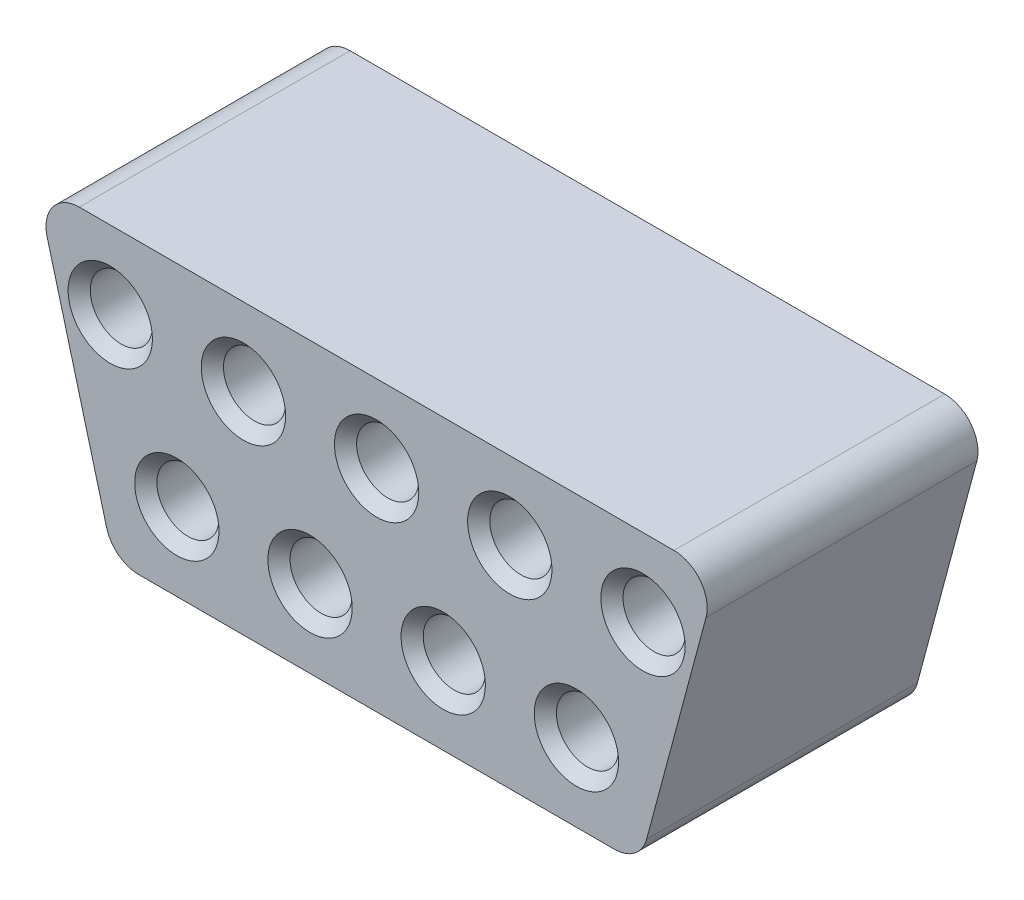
from build123d import *

# Parameters (mm, degrees)
BOSS_EXTRUDE1_DEPTH = 6.1
CUT_EXTRUDE1_REACH  = 12.16
SKETCH2_R           = 0.7
CHAMFER1_SIZE       = 0.25


with BuildPart() as part:
    # Sketch1 → Boss-Extrude1 (new body)
    with BuildSketch(Plane.XY):
        with BuildLine():
            Line((-5.357339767, -3.25), (5.357339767, -3.25))
            ThreePointArc((5.357339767, -3.25), (5.813910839, -3.095015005), (6.081784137, -2.694114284))
            Line((6.081784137, -2.694114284), (7.421530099, 2.305885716))
            ThreePointArc((7.421530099, 2.305885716), (7.292100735, 2.956571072), (6.697085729, 3.25))
            Line((6.697085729, 3.25), (-6.697085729, 3.25))
            ThreePointArc((-6.697085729, 3.25), (-7.292100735, 2.956571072), (-7.421530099, 2.305885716))
            Line((-7.421530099, 2.305885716), (-6.081784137, -2.694114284))
            ThreePointArc((-6.081784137, -2.694114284), (-5.813910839, -3.095015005), (-5.357339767, -3.25))
        make_face()
    extrude(amount=BOSS_EXTRUDE1_DEPTH)

    # Sketch2 → Cut-Extrude1 (cut, up to next)
    with BuildSketch(Plane.XY.offset(6.1), mode=Mode.PRIVATE) as cut_extrude1_sk1:
        with Locations((-5.999496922, 1.5)):
            Circle(SKETCH2_R)
    cut_extrude1_tool1 = extrude(cut_extrude1_sk1.sketch, amount=-CUT_EXTRUDE1_REACH, mode=Mode.PRIVATE) & part.part
    # Sketch2 → Cut-Extrude1 (cut, up to next)
    with BuildSketch(Plane.XY.offset(6.1), mode=Mode.PRIVATE) as cut_extrude1_sk2:
        with Locations((-2.999496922, 1.5)):
            Circle(SKETCH2_R)
    cut_extrude1_tool2 = extrude(cut_extrude1_sk2.sketch, amount=-CUT_EXTRUDE1_REACH, mode=Mode.PRIVATE) & part.part
    # Sketch2 → Cut-Extrude1 (cut, up to next)
    with BuildSketch(Plane.XY.offset(6.1), mode=Mode.PRIVATE) as cut_extrude1_sk3:
        with Locations((0.000503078, 1.5)):
            Circle(SKETCH2_R)
    cut_extrude1_tool3 = extrude(cut_extrude1_sk3.sketch, amount=-CUT_EXTRUDE1_REACH, mode=Mode.PRIVATE) & part.part
    # Sketch2 → Cut-Extrude1 (cut, up to next)
    with BuildSketch(Plane.XY.offset(6.1), mode=Mode.PRIVATE) as cut_extrude1_sk4:
        with Locations((3.000503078, 1.5)):
            Circle(SKETCH2_R)
    cut_extrude1_tool4 = extrude(cut_extrude1_sk4.sketch, amount=-CUT_EXTRUDE1_REACH, mode=Mode.PRIVATE) & part.part
    # Sketch2 → Cut-Extrude1 (cut, up to next)
    with BuildSketch(Plane.XY.offset(6.1), mode=Mode.PRIVATE) as cut_extrude1_sk5:
        with Locations((6.000503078, 1.5)):
            Circle(SKETCH2_R)
    cut_extrude1_tool5 = extrude(cut_extrude1_sk5.sketch, amount=-CUT_EXTRUDE1_REACH, mode=Mode.PRIVATE) & part.part
    # Sketch2 → Cut-Extrude1 (cut, up to next)
    with BuildSketch(Plane.XY.offset(6.1), mode=Mode.PRIVATE) as cut_extrude1_sk6:
        with Locations((-4.499496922, -1.5)):
            Circle(SKETCH2_R)
    cut_extrude1_tool6 = extrude(cut_extrude1_sk6.sketch, amount=-CUT_EXTRUDE1_REACH, mode=Mode.PRIVATE) & part.part
    # Sketch2 → Cut-Extrude1 (cut, up to next)
    with BuildSketch(Plane.XY.offset(6.1), mode=Mode.PRIVATE) as cut_extrude1_sk7:
        with Locations((-1.499496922, -1.5)):
            Circle(SKETCH2_R)
    cut_extrude1_tool7 = extrude(cut_extrude1_sk7.sketch, amount=-CUT_EXTRUDE1_REACH, mode=Mode.PRIVATE) & part.part
    # Sketch2 → Cut-Extrude1 (cut, up to next)
    with BuildSketch(Plane.XY.offset(6.1), mode=Mode.PRIVATE) as cut_extrude1_sk8:
        with Locations((1.500503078, -1.5)):
            Circle(SKETCH2_R)
    cut_extrude1_tool8 = extrude(cut_extrude1_sk8.sketch, amount=-CUT_EXTRUDE1_REACH, mode=Mode.PRIVATE) & part.part
    # Sketch2 → Cut-Extrude1 (cut, up to next)
    with BuildSketch(Plane.XY.offset(6.1), mode=Mode.PRIVATE) as cut_extrude1_sk9:
        with Locations((4.500503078, -1.5)):
            Circle(SKETCH2_R)
    cut_extrude1_tool9 = extrude(cut_extrude1_sk9.sketch, amount=-CUT_EXTRUDE1_REACH, mode=Mode.PRIVATE) & part.part
    add(cut_extrude1_tool1.solids().sort_by_distance((-5.999497, 1.5, 6.1))[0], mode=Mode.SUBTRACT)
    add(cut_extrude1_tool2.solids().sort_by_distance((-2.999497, 1.5, 6.1))[0], mode=Mode.SUBTRACT)
    add(cut_extrude1_tool3.solids().sort_by_distance((0.000503, 1.5, 6.1))[0], mode=Mode.SUBTRACT)
    add(cut_extrude1_tool4.solids().sort_by_distance((3.000503, 1.5, 6.1))[0], mode=Mode.SUBTRACT)
    add(cut_extrude1_tool5.solids().sort_by_distance((6.000503, 1.5, 6.1))[0], mode=Mode.SUBTRACT)
    add(cut_extrude1_tool6.solids().sort_by_distance((-4.499497, -1.5, 6.1))[0], mode=Mode.SUBTRACT)
    add(cut_extrude1_tool7.solids().sort_by_distance((-1.499497, -1.5, 6.1))[0], mode=Mode.SUBTRACT)
    add(cut_extrude1_tool8.solids().sort_by_distance((1.500503, -1.5, 6.1))[0], mode=Mode.SUBTRACT)
    add(cut_extrude1_tool9.solids().sort_by_distance((4.500503, -1.5, 6.1))[0], mode=Mode.SUBTRACT)

    # Chamfer1
    chamfer1_edges = [part.edges().sort_by_distance(p)[0] for p in [
        (-6.699496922, 1.5, 6.1),
        (-3.699496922, 1.5, 6.1),
        (-0.699496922, 1.5, 6.1),
        (2.300503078, 1.5, 6.1),
        (5.300503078, 1.5, 6.1),
        (-5.199496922, -1.5, 6.1),
        (-2.199496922, -1.5, 6.1),
        (0.800503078, -1.5, 6.1),
        (3.800503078, -1.5, 6.1),
    ]]
    chamfer(chamfer1_edges, length=CHAMFER1_SIZE)


solid = part.part
